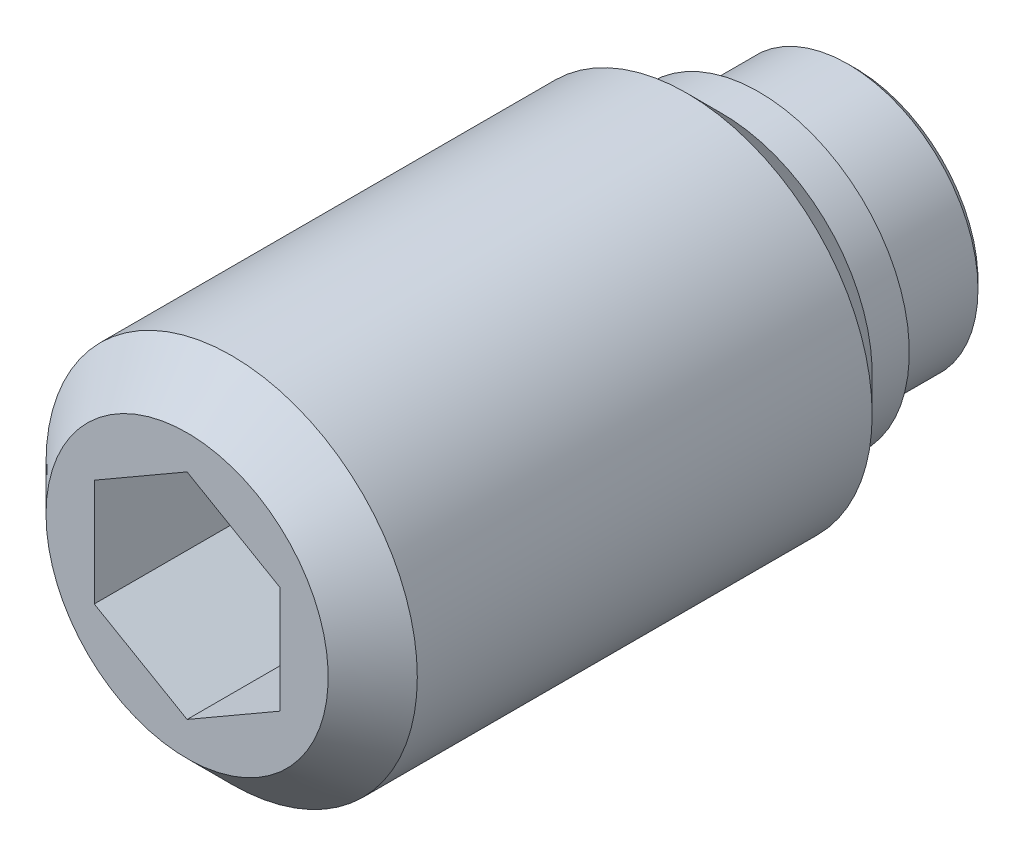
ISO-10303-21;
HEADER;
FILE_DESCRIPTION(('STEP AP214'),'2;1');
FILE_NAME('part.step','',(''),(''),'','','');
FILE_SCHEMA(('AUTOMOTIVE_DESIGN { 1 0 10303 214 1 1 1 1 }'));
ENDSEC;
DATA;
#1=APPLICATION_CONTEXT('core data for automotive mechanical design processes');
#2=APPLICATION_PROTOCOL_DEFINITION('international standard','automotive_design',2000,#1);
#3=PRODUCT_CONTEXT('',#1,'mechanical');
#4=PRODUCT('Part','Part','',(#3));
#5=PRODUCT_RELATED_PRODUCT_CATEGORY('part','',(#4));
#6=PRODUCT_DEFINITION_FORMATION('','',#4);
#7=PRODUCT_DEFINITION_CONTEXT('part definition',#1,'design');
#8=PRODUCT_DEFINITION('design','',#6,#7);
#9=PRODUCT_DEFINITION_SHAPE('','',#8);
#10=(LENGTH_UNIT() NAMED_UNIT(*) SI_UNIT(.MILLI.,.METRE.));
#11=(NAMED_UNIT(*) PLANE_ANGLE_UNIT() SI_UNIT($,.RADIAN.));
#12=(NAMED_UNIT(*) SI_UNIT($,.STERADIAN.) SOLID_ANGLE_UNIT());
#13=UNCERTAINTY_MEASURE_WITH_UNIT(LENGTH_MEASURE(1.E-05),#10,'distance_accuracy_value','');
#14=(GEOMETRIC_REPRESENTATION_CONTEXT(3) GLOBAL_UNCERTAINTY_ASSIGNED_CONTEXT((#13)) GLOBAL_UNIT_ASSIGNED_CONTEXT((#10,
#11,#12)) REPRESENTATION_CONTEXT('',''));
#15=CARTESIAN_POINT('',(0.,0.,0.));
#16=DIRECTION('',(0.,0.,1.));
#17=DIRECTION('',(1.,0.,0.));
#18=AXIS2_PLACEMENT_3D('',#15,#16,#17);
#19=CARTESIAN_POINT('',(0.,4.05,2.6));
#20=DIRECTION('',(0.,0.,1.));
#21=DIRECTION('',(1.,0.,0.));
#22=AXIS2_PLACEMENT_3D('',#19,#20,#21);
#23=PLANE('',#22);
#24=CARTESIAN_POINT('',(0.,0.,2.6));
#25=DIRECTION('',(0.,0.,-1.));
#26=DIRECTION('',(-1.,0.,0.));
#27=AXIS2_PLACEMENT_3D('',#24,#25,#26);
#28=CIRCLE('',#27,3.5);
#29=CARTESIAN_POINT('',(-3.5,0.,2.6));
#30=VERTEX_POINT('',#29);
#31=EDGE_CURVE('E103',#30,#30,#28,.T.);
#32=ORIENTED_EDGE('',*,*,#31,.F.);
#33=EDGE_LOOP('',(#32));
#34=FACE_BOUND('',#33,.T.);
#35=CARTESIAN_POINT('',(0.,0.,2.6));
#36=DIRECTION('',(0.,0.,-1.));
#37=DIRECTION('',(-1.,0.,0.));
#38=AXIS2_PLACEMENT_3D('',#35,#36,#37);
#39=CIRCLE('',#38,4.05);
#40=CARTESIAN_POINT('',(-4.05,0.,2.6));
#41=VERTEX_POINT('',#40);
#42=EDGE_CURVE('E123',#41,#41,#39,.T.);
#43=ORIENTED_EDGE('',*,*,#42,.T.);
#44=EDGE_LOOP('',(#43));
#45=FACE_BOUND('',#44,.T.);
#46=ADVANCED_FACE('F14',(#34,#45),#23,.F.);
#47=CARTESIAN_POINT('',(0.,0.,18.));
#48=DIRECTION('',(0.,0.,-1.));
#49=DIRECTION('',(-1.,0.,0.));
#50=AXIS2_PLACEMENT_3D('',#47,#48,#49);
#51=PLANE('',#50);
#52=CARTESIAN_POINT('',(0.,0.,18.));
#53=DIRECTION('',(0.,0.,-1.));
#54=DIRECTION('',(-1.,0.,0.));
#55=AXIS2_PLACEMENT_3D('',#52,#53,#54);
#56=CIRCLE('',#55,3.8);
#57=CARTESIAN_POINT('',(-3.8,0.,18.));
#58=VERTEX_POINT('',#57);
#59=EDGE_CURVE('E9',#58,#58,#56,.T.);
#60=ORIENTED_EDGE('',*,*,#59,.F.);
#61=EDGE_LOOP('',(#60));
#62=FACE_BOUND('',#61,.T.);
#63=DIRECTION('',(0.866025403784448,-0.499999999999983,0.));
#64=VECTOR('',#63,1.);
#65=CARTESIAN_POINT('',(0.,2.8867513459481,18.));
#66=LINE('',#65,#64);
#67=CARTESIAN_POINT('',(0.,2.8867513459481,18.));
#68=VERTEX_POINT('',#67);
#69=CARTESIAN_POINT('',(2.5,1.4433756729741,18.));
#70=VERTEX_POINT('',#69);
#71=EDGE_CURVE('E29',#68,#70,#66,.T.);
#72=ORIENTED_EDGE('',*,*,#71,.T.);
#73=DIRECTION('',(0.,-1.,0.));
#74=VECTOR('',#73,1.);
#75=CARTESIAN_POINT('',(2.5,1.4433756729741,18.));
#76=LINE('',#75,#74);
#77=CARTESIAN_POINT('',(2.5,-1.4433756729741,18.));
#78=VERTEX_POINT('',#77);
#79=EDGE_CURVE('E102',#70,#78,#76,.T.);
#80=ORIENTED_EDGE('',*,*,#79,.T.);
#81=DIRECTION('',(-0.866025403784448,-0.499999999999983,0.));
#82=VECTOR('',#81,1.);
#83=CARTESIAN_POINT('',(2.5,-1.4433756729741,18.));
#84=LINE('',#83,#82);
#85=CARTESIAN_POINT('',(0.,-2.8867513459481,18.));
#86=VERTEX_POINT('',#85);
#87=EDGE_CURVE('E106',#78,#86,#84,.T.);
#88=ORIENTED_EDGE('',*,*,#87,.T.);
#89=DIRECTION('',(-0.866025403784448,0.499999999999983,0.));
#90=VECTOR('',#89,1.);
#91=CARTESIAN_POINT('',(0.,-2.8867513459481,18.));
#92=LINE('',#91,#90);
#93=CARTESIAN_POINT('',(-2.5,-1.4433756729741,18.));
#94=VERTEX_POINT('',#93);
#95=EDGE_CURVE('E109',#86,#94,#92,.T.);
#96=ORIENTED_EDGE('',*,*,#95,.T.);
#97=DIRECTION('',(0.,1.,0.));
#98=VECTOR('',#97,1.);
#99=CARTESIAN_POINT('',(-2.5,-1.4433756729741,18.));
#100=LINE('',#99,#98);
#101=CARTESIAN_POINT('',(-2.5,1.4433756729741,18.));
#102=VERTEX_POINT('',#101);
#103=EDGE_CURVE('E92',#94,#102,#100,.T.);
#104=ORIENTED_EDGE('',*,*,#103,.T.);
#105=DIRECTION('',(0.866025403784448,0.499999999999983,0.));
#106=VECTOR('',#105,1.);
#107=CARTESIAN_POINT('',(-2.5,1.4433756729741,18.));
#108=LINE('',#107,#106);
#109=EDGE_CURVE('E112',#102,#68,#108,.T.);
#110=ORIENTED_EDGE('',*,*,#109,.T.);
#111=EDGE_LOOP('',(#72,#80,#88,#96,#104,#110));
#112=FACE_BOUND('',#111,.T.);
#113=ADVANCED_FACE('F16',(#62,#112),#51,.F.);
#114=CARTESIAN_POINT('',(0.,0.,18.));
#115=DIRECTION('',(0.,0.,-1.));
#116=DIRECTION('',(-1.,0.,0.));
#117=AXIS2_PLACEMENT_3D('',#114,#115,#116);
#118=CONICAL_SURFACE('',#117,3.8,0.785398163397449);
#119=CARTESIAN_POINT('',(0.,0.,16.8));
#120=DIRECTION('',(0.,0.,-1.));
#121=DIRECTION('',(-1.,0.,0.));
#122=AXIS2_PLACEMENT_3D('',#119,#120,#121);
#123=CIRCLE('',#122,5.);
#124=CARTESIAN_POINT('',(-5.,0.,16.8));
#125=VERTEX_POINT('',#124);
#126=EDGE_CURVE('E22',#125,#125,#123,.T.);
#127=ORIENTED_EDGE('',*,*,#126,.F.);
#128=EDGE_LOOP('',(#127));
#129=FACE_BOUND('',#128,.T.);
#130=ORIENTED_EDGE('',*,*,#59,.T.);
#131=EDGE_LOOP('',(#130));
#132=FACE_BOUND('',#131,.T.);
#133=ADVANCED_FACE('F136',(#129,#132),#118,.T.);
#134=CARTESIAN_POINT('',(0.,0.,2.6));
#135=DIRECTION('',(0.,0.,-1.));
#136=DIRECTION('',(-1.,0.,0.));
#137=AXIS2_PLACEMENT_3D('',#134,#135,#136);
#138=CYLINDRICAL_SURFACE('',#137,5.);
#139=CARTESIAN_POINT('',(0.,0.,4.55));
#140=DIRECTION('',(0.,0.,-1.));
#141=DIRECTION('',(-1.,0.,0.));
#142=AXIS2_PLACEMENT_3D('',#139,#140,#141);
#143=CIRCLE('',#142,5.);
#144=CARTESIAN_POINT('',(-5.,0.,4.55));
#145=VERTEX_POINT('',#144);
#146=EDGE_CURVE('E129',#145,#145,#143,.T.);
#147=ORIENTED_EDGE('',*,*,#146,.F.);
#148=EDGE_LOOP('',(#147));
#149=FACE_BOUND('',#148,.T.);
#150=ORIENTED_EDGE('',*,*,#126,.T.);
#151=EDGE_LOOP('',(#150));
#152=FACE_BOUND('',#151,.T.);
#153=ADVANCED_FACE('F134',(#149,#152),#138,.T.);
#154=CARTESIAN_POINT('',(0.,0.,4.55));
#155=DIRECTION('',(0.,0.,1.));
#156=DIRECTION('',(1.,0.,0.));
#157=AXIS2_PLACEMENT_3D('',#154,#155,#156);
#158=CONICAL_SURFACE('',#157,5.,0.785398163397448);
#159=CARTESIAN_POINT('',(0.,0.,3.6));
#160=DIRECTION('',(0.,0.,-1.));
#161=DIRECTION('',(-1.,0.,0.));
#162=AXIS2_PLACEMENT_3D('',#159,#160,#161);
#163=CIRCLE('',#162,4.05);
#164=CARTESIAN_POINT('',(-4.05,0.,3.6));
#165=VERTEX_POINT('',#164);
#166=EDGE_CURVE('E126',#165,#165,#163,.T.);
#167=ORIENTED_EDGE('',*,*,#166,.F.);
#168=EDGE_LOOP('',(#167));
#169=FACE_BOUND('',#168,.T.);
#170=ORIENTED_EDGE('',*,*,#146,.T.);
#171=EDGE_LOOP('',(#170));
#172=FACE_BOUND('',#171,.T.);
#173=ADVANCED_FACE('F178',(#169,#172),#158,.T.);
#174=CARTESIAN_POINT('',(0.,0.,2.6));
#175=DIRECTION('',(0.,0.,-1.));
#176=DIRECTION('',(-1.,0.,0.));
#177=AXIS2_PLACEMENT_3D('',#174,#175,#176);
#178=CYLINDRICAL_SURFACE('',#177,4.05);
#179=ORIENTED_EDGE('',*,*,#42,.F.);
#180=EDGE_LOOP('',(#179));
#181=FACE_BOUND('',#180,.T.);
#182=ORIENTED_EDGE('',*,*,#166,.T.);
#183=EDGE_LOOP('',(#182));
#184=FACE_BOUND('',#183,.T.);
#185=ADVANCED_FACE('F165',(#181,#184),#178,.T.);
#186=CARTESIAN_POINT('',(0.,2.8867513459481,12.));
#187=DIRECTION('',(-0.499999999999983,-0.866025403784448,0.));
#188=DIRECTION('',(-0.866025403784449,0.499999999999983,0.));
#189=AXIS2_PLACEMENT_3D('',#186,#187,#188);
#190=PLANE('',#189);
#191=ORIENTED_EDGE('',*,*,#71,.F.);
#192=DIRECTION('',(0.,0.,1.));
#193=VECTOR('',#192,1.);
#194=CARTESIAN_POINT('',(0.,2.8867513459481,12.));
#195=LINE('',#194,#193);
#196=CARTESIAN_POINT('',(0.,2.8867513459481,12.));
#197=VERTEX_POINT('',#196);
#198=EDGE_CURVE('E97',#197,#68,#195,.T.);
#199=ORIENTED_EDGE('',*,*,#198,.F.);
#200=DIRECTION('',(0.866025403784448,-0.499999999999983,0.));
#201=VECTOR('',#200,1.);
#202=CARTESIAN_POINT('',(0.,2.8867513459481,12.));
#203=LINE('',#202,#201);
#204=CARTESIAN_POINT('',(2.5,1.4433756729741,12.));
#205=VERTEX_POINT('',#204);
#206=EDGE_CURVE('E115',#197,#205,#203,.T.);
#207=ORIENTED_EDGE('',*,*,#206,.T.);
#208=DIRECTION('',(0.,0.,1.));
#209=VECTOR('',#208,1.);
#210=CARTESIAN_POINT('',(2.5,1.4433756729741,12.));
#211=LINE('',#210,#209);
#212=EDGE_CURVE('E121',#205,#70,#211,.T.);
#213=ORIENTED_EDGE('',*,*,#212,.T.);
#214=EDGE_LOOP('',(#191,#199,#207,#213));
#215=FACE_BOUND('',#214,.T.);
#216=ADVANCED_FACE('F144',(#215),#190,.T.);
#217=CARTESIAN_POINT('',(2.5,1.4433756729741,12.));
#218=DIRECTION('',(-1.,0.,0.));
#219=DIRECTION('',(0.,0.,1.));
#220=AXIS2_PLACEMENT_3D('',#217,#218,#219);
#221=PLANE('',#220);
#222=ORIENTED_EDGE('',*,*,#79,.F.);
#223=ORIENTED_EDGE('',*,*,#212,.F.);
#224=DIRECTION('',(0.,-1.,0.));
#225=VECTOR('',#224,1.);
#226=CARTESIAN_POINT('',(2.5,1.4433756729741,12.));
#227=LINE('',#226,#225);
#228=CARTESIAN_POINT('',(2.5,-1.4433756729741,12.));
#229=VERTEX_POINT('',#228);
#230=EDGE_CURVE('E69',#205,#229,#227,.T.);
#231=ORIENTED_EDGE('',*,*,#230,.T.);
#232=DIRECTION('',(0.,0.,1.));
#233=VECTOR('',#232,1.);
#234=CARTESIAN_POINT('',(2.5,-1.4433756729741,12.));
#235=LINE('',#234,#233);
#236=EDGE_CURVE('E119',#229,#78,#235,.T.);
#237=ORIENTED_EDGE('',*,*,#236,.T.);
#238=EDGE_LOOP('',(#222,#223,#231,#237));
#239=FACE_BOUND('',#238,.T.);
#240=ADVANCED_FACE('F155',(#239),#221,.T.);
#241=CARTESIAN_POINT('',(2.5,-1.4433756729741,12.));
#242=DIRECTION('',(-0.499999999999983,0.866025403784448,0.));
#243=DIRECTION('',(0.866025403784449,0.499999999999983,0.));
#244=AXIS2_PLACEMENT_3D('',#241,#242,#243);
#245=PLANE('',#244);
#246=ORIENTED_EDGE('',*,*,#87,.F.);
#247=ORIENTED_EDGE('',*,*,#236,.F.);
#248=DIRECTION('',(-0.866025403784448,-0.499999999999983,0.));
#249=VECTOR('',#248,1.);
#250=CARTESIAN_POINT('',(2.5,-1.4433756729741,12.));
#251=LINE('',#250,#249);
#252=CARTESIAN_POINT('',(0.,-2.8867513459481,12.));
#253=VERTEX_POINT('',#252);
#254=EDGE_CURVE('E88',#229,#253,#251,.T.);
#255=ORIENTED_EDGE('',*,*,#254,.T.);
#256=DIRECTION('',(0.,0.,1.));
#257=VECTOR('',#256,1.);
#258=CARTESIAN_POINT('',(0.,-2.8867513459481,12.));
#259=LINE('',#258,#257);
#260=EDGE_CURVE('E85',#253,#86,#259,.T.);
#261=ORIENTED_EDGE('',*,*,#260,.T.);
#262=EDGE_LOOP('',(#246,#247,#255,#261));
#263=FACE_BOUND('',#262,.T.);
#264=ADVANCED_FACE('F153',(#263),#245,.T.);
#265=CARTESIAN_POINT('',(0.,-2.8867513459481,12.));
#266=DIRECTION('',(0.499999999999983,0.866025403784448,0.));
#267=DIRECTION('',(0.866025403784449,-0.499999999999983,0.));
#268=AXIS2_PLACEMENT_3D('',#265,#266,#267);
#269=PLANE('',#268);
#270=ORIENTED_EDGE('',*,*,#95,.F.);
#271=ORIENTED_EDGE('',*,*,#260,.F.);
#272=DIRECTION('',(-0.866025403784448,0.499999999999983,0.));
#273=VECTOR('',#272,1.);
#274=CARTESIAN_POINT('',(0.,-2.8867513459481,12.));
#275=LINE('',#274,#273);
#276=CARTESIAN_POINT('',(-2.5,-1.4433756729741,12.));
#277=VERTEX_POINT('',#276);
#278=EDGE_CURVE('E80',#253,#277,#275,.T.);
#279=ORIENTED_EDGE('',*,*,#278,.T.);
#280=DIRECTION('',(0.,0.,1.));
#281=VECTOR('',#280,1.);
#282=CARTESIAN_POINT('',(-2.5,-1.4433756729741,12.));
#283=LINE('',#282,#281);
#284=EDGE_CURVE('E84',#277,#94,#283,.T.);
#285=ORIENTED_EDGE('',*,*,#284,.T.);
#286=EDGE_LOOP('',(#270,#271,#279,#285));
#287=FACE_BOUND('',#286,.T.);
#288=ADVANCED_FACE('F83',(#287),#269,.T.);
#289=CARTESIAN_POINT('',(-2.5,-1.4433756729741,12.));
#290=DIRECTION('',(1.,0.,0.));
#291=DIRECTION('',(0.,0.,-1.));
#292=AXIS2_PLACEMENT_3D('',#289,#290,#291);
#293=PLANE('',#292);
#294=ORIENTED_EDGE('',*,*,#103,.F.);
#295=ORIENTED_EDGE('',*,*,#284,.F.);
#296=DIRECTION('',(0.,1.,0.));
#297=VECTOR('',#296,1.);
#298=CARTESIAN_POINT('',(-2.5,-1.4433756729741,12.));
#299=LINE('',#298,#297);
#300=CARTESIAN_POINT('',(-2.5,1.4433756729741,12.));
#301=VERTEX_POINT('',#300);
#302=EDGE_CURVE('E87',#277,#301,#299,.T.);
#303=ORIENTED_EDGE('',*,*,#302,.T.);
#304=DIRECTION('',(0.,0.,1.));
#305=VECTOR('',#304,1.);
#306=CARTESIAN_POINT('',(-2.5,1.4433756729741,12.));
#307=LINE('',#306,#305);
#308=EDGE_CURVE('E60',#301,#102,#307,.T.);
#309=ORIENTED_EDGE('',*,*,#308,.T.);
#310=EDGE_LOOP('',(#294,#295,#303,#309));
#311=FACE_BOUND('',#310,.T.);
#312=ADVANCED_FACE('F90',(#311),#293,.T.);
#313=CARTESIAN_POINT('',(-2.5,1.4433756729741,12.));
#314=DIRECTION('',(0.499999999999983,-0.866025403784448,0.));
#315=DIRECTION('',(-0.866025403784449,-0.499999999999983,0.));
#316=AXIS2_PLACEMENT_3D('',#313,#314,#315);
#317=PLANE('',#316);
#318=ORIENTED_EDGE('',*,*,#109,.F.);
#319=ORIENTED_EDGE('',*,*,#308,.F.);
#320=DIRECTION('',(0.866025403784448,0.499999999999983,0.));
#321=VECTOR('',#320,1.);
#322=CARTESIAN_POINT('',(-2.5,1.4433756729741,12.));
#323=LINE('',#322,#321);
#324=EDGE_CURVE('E37',#301,#197,#323,.T.);
#325=ORIENTED_EDGE('',*,*,#324,.T.);
#326=ORIENTED_EDGE('',*,*,#198,.T.);
#327=EDGE_LOOP('',(#318,#319,#325,#326));
#328=FACE_BOUND('',#327,.T.);
#329=ADVANCED_FACE('F143',(#328),#317,.T.);
#330=CARTESIAN_POINT('',(0.,0.,12.));
#331=DIRECTION('',(0.,0.,-1.));
#332=DIRECTION('',(-1.,0.,0.));
#333=AXIS2_PLACEMENT_3D('',#330,#331,#332);
#334=PLANE('',#333);
#335=ORIENTED_EDGE('',*,*,#206,.F.);
#336=ORIENTED_EDGE('',*,*,#324,.F.);
#337=ORIENTED_EDGE('',*,*,#302,.F.);
#338=ORIENTED_EDGE('',*,*,#278,.F.);
#339=ORIENTED_EDGE('',*,*,#254,.F.);
#340=ORIENTED_EDGE('',*,*,#230,.F.);
#341=EDGE_LOOP('',(#335,#336,#337,#338,#339,#340));
#342=FACE_BOUND('',#341,.T.);
#343=ADVANCED_FACE('F95',(#342),#334,.F.);
#344=CARTESIAN_POINT('',(0.,0.,-1.5));
#345=DIRECTION('',(0.,0.,-1.));
#346=DIRECTION('',(-1.,0.,0.));
#347=AXIS2_PLACEMENT_3D('',#344,#345,#346);
#348=CYLINDRICAL_SURFACE('',#347,3.5);
#349=CARTESIAN_POINT('',(0.,0.,0.2));
#350=DIRECTION('',(0.,0.,-1.));
#351=DIRECTION('',(-1.,0.,0.));
#352=AXIS2_PLACEMENT_3D('',#349,#350,#351);
#353=CIRCLE('',#352,3.5);
#354=CARTESIAN_POINT('',(-3.5,0.,0.2));
#355=VERTEX_POINT('',#354);
#356=EDGE_CURVE('E322',#355,#355,#353,.T.);
#357=ORIENTED_EDGE('',*,*,#356,.F.);
#358=EDGE_LOOP('',(#357));
#359=FACE_BOUND('',#358,.T.);
#360=ORIENTED_EDGE('',*,*,#31,.T.);
#361=EDGE_LOOP('',(#360));
#362=FACE_BOUND('',#361,.T.);
#363=ADVANCED_FACE('F263',(#359,#362),#348,.T.);
#364=CARTESIAN_POINT('',(0.,0.,0.2));
#365=DIRECTION('',(0.,0.,1.));
#366=DIRECTION('',(1.,0.,0.));
#367=AXIS2_PLACEMENT_3D('',#364,#365,#366);
#368=CONICAL_SURFACE('',#367,3.5,0.785398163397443);
#369=CARTESIAN_POINT('',(0.,0.,0.));
#370=DIRECTION('',(0.,0.,-1.));
#371=DIRECTION('',(-1.,0.,0.));
#372=AXIS2_PLACEMENT_3D('',#369,#370,#371);
#373=CIRCLE('',#372,3.3);
#374=CARTESIAN_POINT('',(-3.3,0.,0.));
#375=VERTEX_POINT('',#374);
#376=EDGE_CURVE('E319',#375,#375,#373,.T.);
#377=ORIENTED_EDGE('',*,*,#376,.F.);
#378=EDGE_LOOP('',(#377));
#379=FACE_BOUND('',#378,.T.);
#380=ORIENTED_EDGE('',*,*,#356,.T.);
#381=EDGE_LOOP('',(#380));
#382=FACE_BOUND('',#381,.T.);
#383=ADVANCED_FACE('F270',(#379,#382),#368,.T.);
#384=CARTESIAN_POINT('',(0.,3.3,0.));
#385=DIRECTION('',(0.,0.,1.));
#386=DIRECTION('',(1.,0.,0.));
#387=AXIS2_PLACEMENT_3D('',#384,#385,#386);
#388=PLANE('',#387);
#389=CARTESIAN_POINT('',(0.,0.,0.));
#390=DIRECTION('',(0.,0.,-1.));
#391=DIRECTION('',(-1.,0.,0.));
#392=AXIS2_PLACEMENT_3D('',#389,#390,#391);
#393=CIRCLE('',#392,1.5);
#394=CARTESIAN_POINT('',(-1.5,0.,0.));
#395=VERTEX_POINT('',#394);
#396=EDGE_CURVE('E318',#395,#395,#393,.T.);
#397=ORIENTED_EDGE('',*,*,#396,.F.);
#398=EDGE_LOOP('',(#397));
#399=FACE_BOUND('',#398,.T.);
#400=ORIENTED_EDGE('',*,*,#376,.T.);
#401=EDGE_LOOP('',(#400));
#402=FACE_BOUND('',#401,.T.);
#403=ADVANCED_FACE('F278',(#399,#402),#388,.F.);
#404=CARTESIAN_POINT('',(0.,0.,0.));
#405=DIRECTION('',(0.,0.,1.));
#406=DIRECTION('',(1.,0.,0.));
#407=AXIS2_PLACEMENT_3D('',#404,#405,#406);
#408=CONICAL_SURFACE('',#407,1.5,0.785398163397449);
#409=CARTESIAN_POINT('',(0.,0.,-1.5));
#410=VERTEX_POINT('',#409);
#411=VERTEX_LOOP('',#410);
#412=FACE_BOUND('',#411,.T.);
#413=ORIENTED_EDGE('',*,*,#396,.T.);
#414=EDGE_LOOP('',(#413));
#415=FACE_BOUND('',#414,.T.);
#416=ADVANCED_FACE('F286',(#412,#415),#408,.T.);
#417=CLOSED_SHELL('',(#46,#113,#133,#153,#173,#185,#216,#240,#264,#288,#312,#329,#343,#363,#383,
#403,#416));
#418=MANIFOLD_SOLID_BREP('B1',#417);
#419=ADVANCED_BREP_SHAPE_REPRESENTATION('',(#18,#418),#14);
#420=SHAPE_DEFINITION_REPRESENTATION(#9,#419);
ENDSEC;
END-ISO-10303-21;
